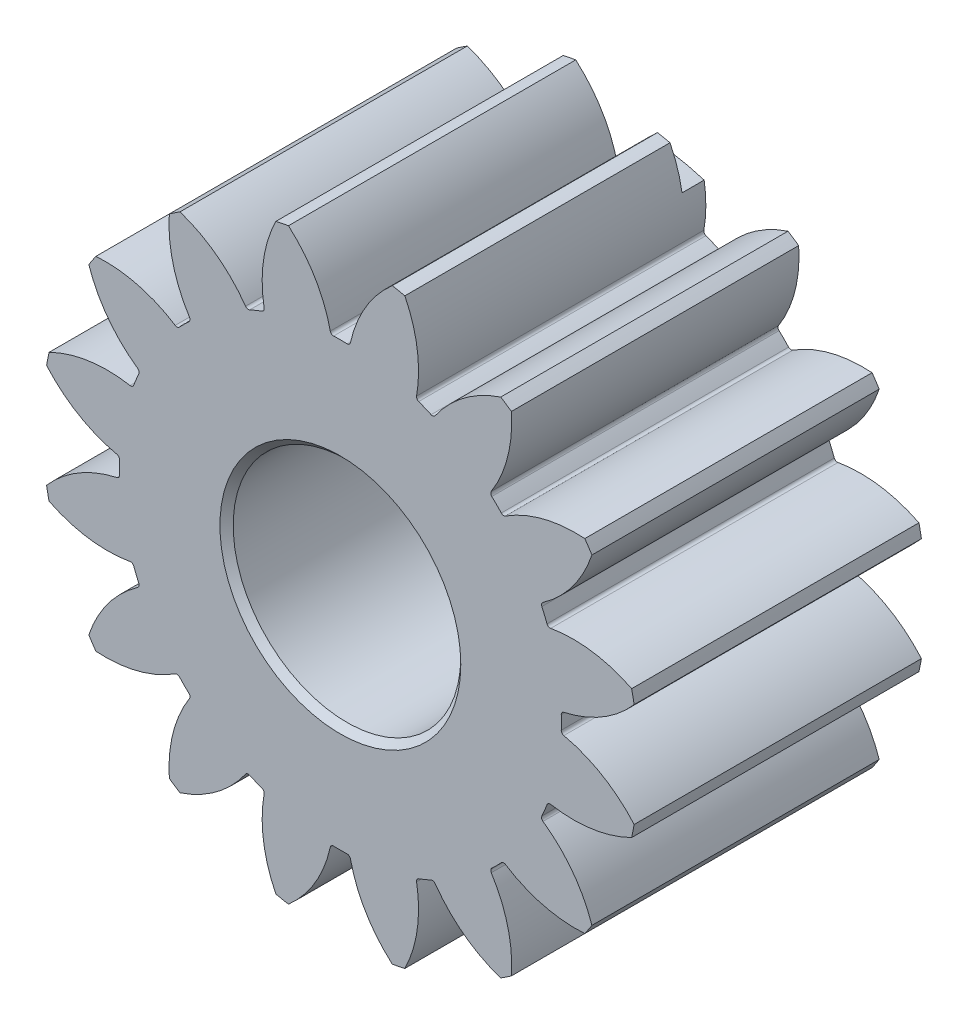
from build123d import *

# Parameters (mm, degrees)
ESQUISSE1_R                  = 13.5
EBAUCHE_EXT_RIEURE_DEPTH     = 13
ESQUISSE2_R                  = 5.15
AL_SAGE_10_3_DEPTH           = 24.097618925
CHANFREIN1_SIZE              = 0.3
DENTURE_DEPTH                = 24.097618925
R_P_TITION_CIRCULAIRE1_COUNT = 16
ENL_V_MAT_EXTRU_1_DEPTH      = 1


with BuildPart() as part:
    # Esquisse1 → Ebauche ext_rieure (new body)
    with BuildSketch(Plane.XY):
        Circle(ESQUISSE1_R)
    extrude(amount=EBAUCHE_EXT_RIEURE_DEPTH)

    # Esquisse2 → al_sage 10.3 (cut, through all)
    with BuildSketch(Plane.XY.offset(13)):
        Circle(ESQUISSE2_R)
    extrude(amount=-AL_SAGE_10_3_DEPTH, mode=Mode.SUBTRACT)

    # Chanfrein1
    chanfrein1_edges = [part.edges().sort_by_distance(p)[0] for p in [
        (-5.15, 0, 0),
        (-5.15, 0, 13),
    ]]
    chamfer(chanfrein1_edges, length=CHANFREIN1_SIZE)

    # Esquisse3 → denture (cut, through all)
    with BuildSketch(Plane(origin=(0, 0, 0), x_dir=(-1, 0, 0), z_dir=(0, 0, -1))):
        with BuildLine():
            ThreePointArc((-2.348564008, 13.294143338), (-1.146470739, 11.855542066), (-0.455438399, 10.11282116))
            ThreePointArc((-0.455438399, 10.11282116), (-0.401089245, 10.026894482), (-0.304429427, 9.995365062))
            ThreePointArc((-0.304429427, 9.995365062), (0, 10), (0.304429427, 9.995365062))
            ThreePointArc((0.304429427, 9.995365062), (0.401089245, 10.026894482), (0.455438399, 10.11282116))
            ThreePointArc((0.455438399, 10.11282116), (1.146470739, 11.855542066), (2.348564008, 13.294143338))
            ThreePointArc((2.348564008, 13.294143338), (0, 13.5), (-2.348564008, 13.294143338))
        make_face()
    denture = extrude(amount=-DENTURE_DEPTH, mode=Mode.SUBTRACT)

    # R_p_tition circulaire1: denture ×16 about axis
    r_p_tition_circulaire1_axis = Axis((0, 0, 0), (0, 0, 1))
    for i in range(1, R_P_TITION_CIRCULAIRE1_COUNT):
        add(denture.rotate(r_p_tition_circulaire1_axis, i * 360 / R_P_TITION_CIRCULAIRE1_COUNT), mode=Mode.SUBTRACT)

    # Esquisse4 → Enl_v. mat.-Extru.1 (cut)
    with BuildSketch(Plane(origin=(0, 0, 0), x_dir=(-1, 0, 0), z_dir=(0, 0, -1))):
        with BuildLine():
            Line((-4.538041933, 11.108833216), (-6.253754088, 15.308785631))
            Line((-6.253754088, 15.308785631), (0, 16.302013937))
            Line((0, 16.302013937), (0, 12))
            ThreePointArc((0, 12), (-2.312358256, 11.775100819), (-4.538041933, 11.108833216))
        make_face()
    extrude(amount=-ENL_V_MAT_EXTRU_1_DEPTH, mode=Mode.SUBTRACT)


solid = part.part
